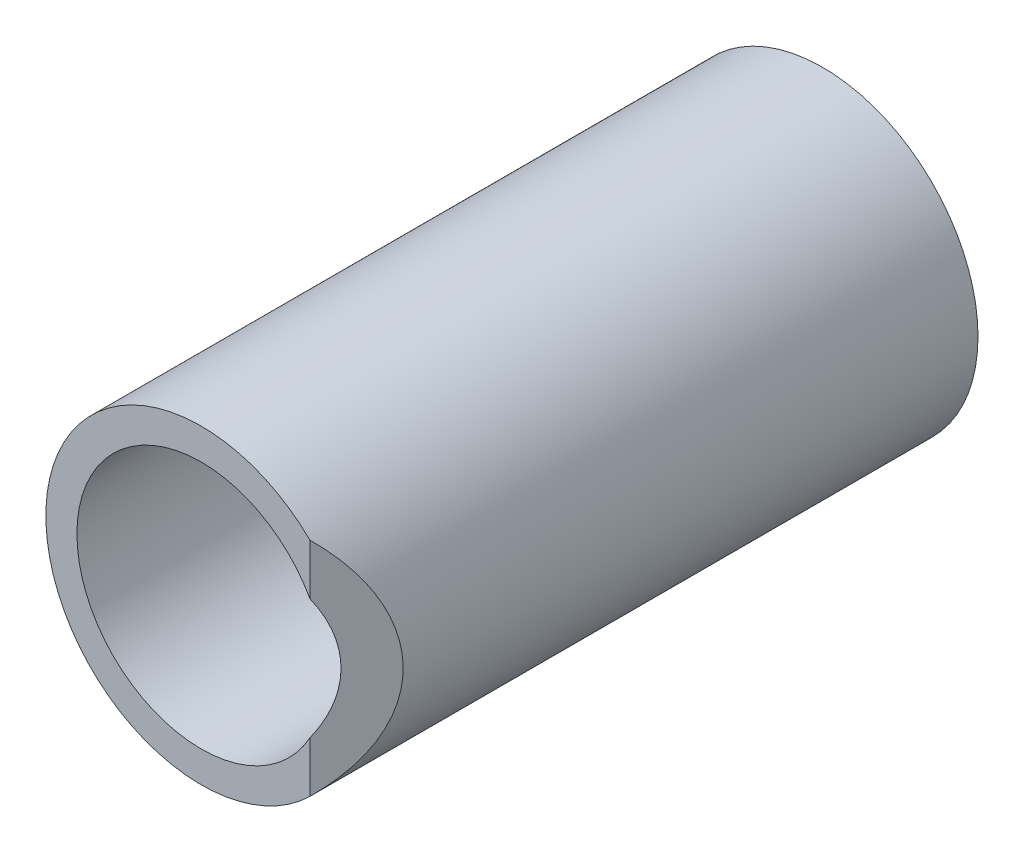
ISO-10303-21;
HEADER;
FILE_DESCRIPTION(('STEP AP214'),'2;1');
FILE_NAME('part.step','',(''),(''),'','','');
FILE_SCHEMA(('AUTOMOTIVE_DESIGN { 1 0 10303 214 1 1 1 1 }'));
ENDSEC;
DATA;
#1=APPLICATION_CONTEXT('core data for automotive mechanical design processes');
#2=APPLICATION_PROTOCOL_DEFINITION('international standard','automotive_design',2000,#1);
#3=PRODUCT_CONTEXT('',#1,'mechanical');
#4=PRODUCT('Part','Part','',(#3));
#5=PRODUCT_RELATED_PRODUCT_CATEGORY('part','',(#4));
#6=PRODUCT_DEFINITION_FORMATION('','',#4);
#7=PRODUCT_DEFINITION_CONTEXT('part definition',#1,'design');
#8=PRODUCT_DEFINITION('design','',#6,#7);
#9=PRODUCT_DEFINITION_SHAPE('','',#8);
#10=(LENGTH_UNIT() NAMED_UNIT(*) SI_UNIT(.MILLI.,.METRE.));
#11=(NAMED_UNIT(*) PLANE_ANGLE_UNIT() SI_UNIT($,.RADIAN.));
#12=(NAMED_UNIT(*) SI_UNIT($,.STERADIAN.) SOLID_ANGLE_UNIT());
#13=UNCERTAINTY_MEASURE_WITH_UNIT(LENGTH_MEASURE(1.E-05),#10,'distance_accuracy_value','');
#14=(GEOMETRIC_REPRESENTATION_CONTEXT(3) GLOBAL_UNCERTAINTY_ASSIGNED_CONTEXT((#13)) GLOBAL_UNIT_ASSIGNED_CONTEXT((#10,
#11,#12)) REPRESENTATION_CONTEXT('',''));
#15=CARTESIAN_POINT('',(0.,0.,0.));
#16=DIRECTION('',(0.,0.,1.));
#17=DIRECTION('',(1.,0.,0.));
#18=AXIS2_PLACEMENT_3D('',#15,#16,#17);
#19=CARTESIAN_POINT('',(0.,0.,100.));
#20=DIRECTION('',(0.,0.,1.));
#21=DIRECTION('',(1.,0.,0.));
#22=AXIS2_PLACEMENT_3D('',#19,#20,#21);
#23=PLANE('',#22);
#24=DIRECTION('',(0.,-1.,0.));
#25=VECTOR('',#24,1.);
#26=CARTESIAN_POINT('',(17.5,475.,100.));
#27=LINE('',#26,#25);
#28=CARTESIAN_POINT('',(17.5,17.8535710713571,100.));
#29=VERTEX_POINT('',#28);
#30=CARTESIAN_POINT('',(17.5,9.6824583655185,100.));
#31=VERTEX_POINT('',#30);
#32=EDGE_CURVE('E54',#29,#31,#27,.T.);
#33=ORIENTED_EDGE('',*,*,#32,.F.);
#34=CARTESIAN_POINT('',(0.,0.,100.));
#35=DIRECTION('',(0.,0.,1.));
#36=DIRECTION('',(1.,0.,0.));
#37=AXIS2_PLACEMENT_3D('',#34,#35,#36);
#38=CIRCLE('',#37,25.);
#39=CARTESIAN_POINT('',(17.5,-17.8535710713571,100.));
#40=VERTEX_POINT('',#39);
#41=EDGE_CURVE('E48',#29,#40,#38,.T.);
#42=ORIENTED_EDGE('',*,*,#41,.T.);
#43=CARTESIAN_POINT('',(17.5,-9.68245836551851,100.));
#44=VERTEX_POINT('',#43);
#45=EDGE_CURVE('E67',#44,#40,#27,.T.);
#46=ORIENTED_EDGE('',*,*,#45,.F.);
#47=CARTESIAN_POINT('',(0.,0.,100.));
#48=DIRECTION('',(0.,0.,1.));
#49=DIRECTION('',(1.,0.,0.));
#50=AXIS2_PLACEMENT_3D('',#47,#48,#49);
#51=CIRCLE('',#50,20.);
#52=EDGE_CURVE('E75',#31,#44,#51,.T.);
#53=ORIENTED_EDGE('',*,*,#52,.F.);
#54=EDGE_LOOP('',(#33,#42,#46,#53));
#55=FACE_BOUND('',#54,.T.);
#56=ADVANCED_FACE('F39',(#55),#23,.T.);
#57=CARTESIAN_POINT('',(0.,0.,0.));
#58=DIRECTION('',(0.,0.,1.));
#59=DIRECTION('',(1.,0.,0.));
#60=AXIS2_PLACEMENT_3D('',#57,#58,#59);
#61=PLANE('',#60);
#62=CARTESIAN_POINT('',(0.,0.,0.));
#63=DIRECTION('',(0.,0.,1.));
#64=DIRECTION('',(1.,0.,0.));
#65=AXIS2_PLACEMENT_3D('',#62,#63,#64);
#66=CIRCLE('',#65,25.);
#67=CARTESIAN_POINT('',(25.,0.,0.));
#68=VERTEX_POINT('',#67);
#69=EDGE_CURVE('E80',#68,#68,#66,.T.);
#70=ORIENTED_EDGE('',*,*,#69,.F.);
#71=EDGE_LOOP('',(#70));
#72=FACE_BOUND('',#71,.T.);
#73=CARTESIAN_POINT('',(0.,0.,0.));
#74=DIRECTION('',(0.,0.,1.));
#75=DIRECTION('',(1.,0.,0.));
#76=AXIS2_PLACEMENT_3D('',#73,#74,#75);
#77=CIRCLE('',#76,20.);
#78=CARTESIAN_POINT('',(20.,0.,0.));
#79=VERTEX_POINT('',#78);
#80=EDGE_CURVE('E70',#79,#79,#77,.T.);
#81=ORIENTED_EDGE('',*,*,#80,.T.);
#82=EDGE_LOOP('',(#81));
#83=FACE_BOUND('',#82,.T.);
#84=ADVANCED_FACE('F97',(#72,#83),#61,.F.);
#85=CARTESIAN_POINT('',(0.,0.,100.));
#86=DIRECTION('',(0.,0.,-1.));
#87=DIRECTION('',(-1.,0.,0.));
#88=AXIS2_PLACEMENT_3D('',#85,#86,#87);
#89=CYLINDRICAL_SURFACE('',#88,25.);
#90=CARTESIAN_POINT('',(0.,0.,117.5));
#91=DIRECTION('',(-0.707106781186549,0.,-0.707106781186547));
#92=DIRECTION('',(0.707106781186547,0.,-0.707106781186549));
#93=AXIS2_PLACEMENT_3D('',#90,#91,#92);
#94=ELLIPSE('',#93,35.3553390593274,25.);
#95=EDGE_CURVE('E60',#29,#40,#94,.T.);
#96=ORIENTED_EDGE('',*,*,#95,.T.);
#97=ORIENTED_EDGE('',*,*,#41,.F.);
#98=EDGE_LOOP('',(#96,#97));
#99=FACE_BOUND('',#98,.T.);
#100=ORIENTED_EDGE('',*,*,#69,.T.);
#101=EDGE_LOOP('',(#100));
#102=FACE_BOUND('',#101,.T.);
#103=ADVANCED_FACE('F41',(#99,#102),#89,.T.);
#104=CARTESIAN_POINT('',(0.,0.,100.));
#105=DIRECTION('',(0.,0.,-1.));
#106=DIRECTION('',(-1.,0.,0.));
#107=AXIS2_PLACEMENT_3D('',#104,#105,#106);
#108=CYLINDRICAL_SURFACE('',#107,20.);
#109=CARTESIAN_POINT('',(0.,0.,117.5));
#110=DIRECTION('',(-0.707106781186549,0.,-0.707106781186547));
#111=DIRECTION('',(0.707106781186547,0.,-0.707106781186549));
#112=AXIS2_PLACEMENT_3D('',#109,#110,#111);
#113=ELLIPSE('',#112,28.2842712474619,20.);
#114=EDGE_CURVE('E11',#31,#44,#113,.T.);
#115=ORIENTED_EDGE('',*,*,#114,.F.);
#116=ORIENTED_EDGE('',*,*,#52,.T.);
#117=EDGE_LOOP('',(#115,#116));
#118=FACE_BOUND('',#117,.T.);
#119=ORIENTED_EDGE('',*,*,#80,.F.);
#120=EDGE_LOOP('',(#119));
#121=FACE_BOUND('',#120,.T.);
#122=ADVANCED_FACE('F91',(#118,#121),#108,.F.);
#123=CARTESIAN_POINT('',(17.5,475.,100.));
#124=DIRECTION('',(-0.707106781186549,0.,-0.707106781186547));
#125=DIRECTION('',(-0.707106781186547,0.,0.707106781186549));
#126=AXIS2_PLACEMENT_3D('',#123,#124,#125);
#127=PLANE('',#126);
#128=ORIENTED_EDGE('',*,*,#95,.F.);
#129=ORIENTED_EDGE('',*,*,#32,.T.);
#130=ORIENTED_EDGE('',*,*,#114,.T.);
#131=ORIENTED_EDGE('',*,*,#45,.T.);
#132=EDGE_LOOP('',(#128,#129,#130,#131));
#133=FACE_BOUND('',#132,.T.);
#134=ADVANCED_FACE('F65',(#133),#127,.F.);
#135=CLOSED_SHELL('',(#56,#84,#103,#122,#134));
#136=MANIFOLD_SOLID_BREP('B2',#135);
#137=ADVANCED_BREP_SHAPE_REPRESENTATION('',(#18,#136),#14);
#138=SHAPE_DEFINITION_REPRESENTATION(#9,#137);
ENDSEC;
END-ISO-10303-21;
